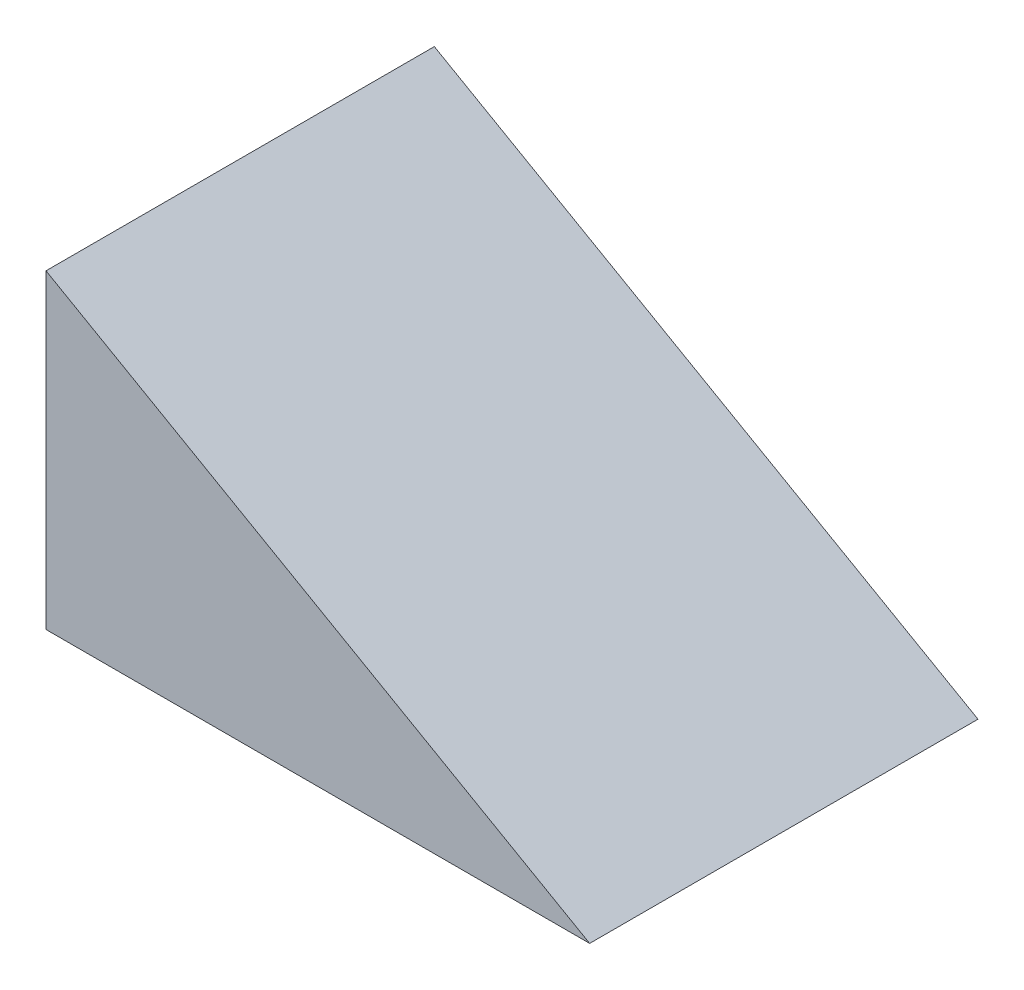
from build123d import *

# Parameters (mm, degrees)
BOSS_EXTRUDE1_DEPTH = 50


with BuildPart() as part:
    # Sketch1 → Boss-Extrude1 (new body)
    with BuildSketch(Plane.XY):
        Polygon((0, 0), (70, 0), (0, 40), align=None)
    extrude(amount=BOSS_EXTRUDE1_DEPTH)


solid = part.part
